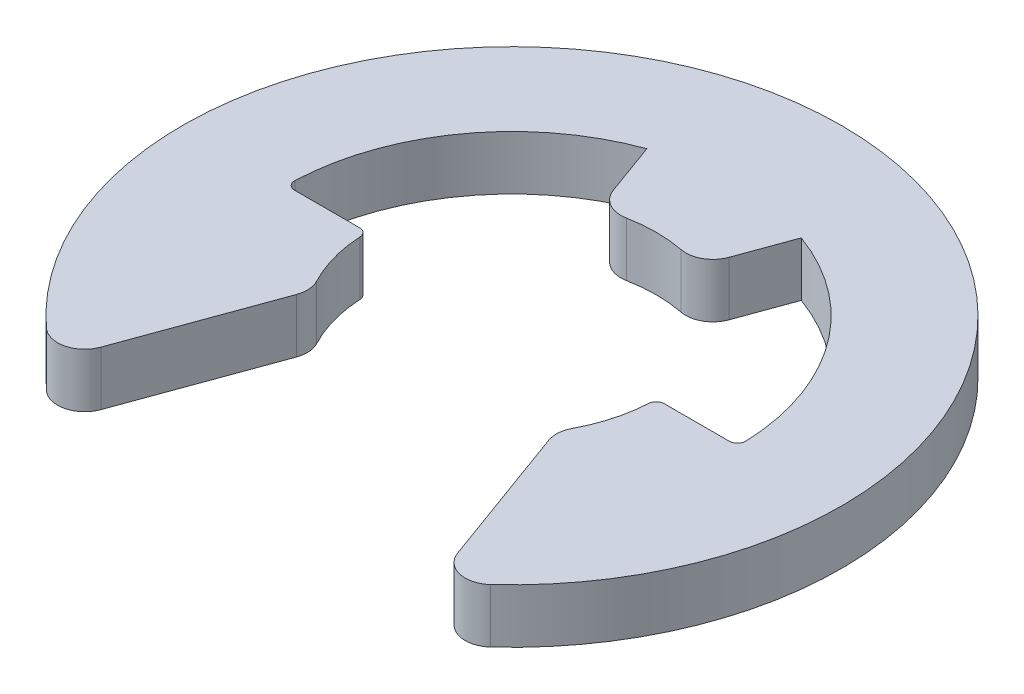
ISO-10303-21;
HEADER;
FILE_DESCRIPTION(('STEP AP214'),'2;1');
FILE_NAME('part.step','',(''),(''),'','','');
FILE_SCHEMA(('AUTOMOTIVE_DESIGN { 1 0 10303 214 1 1 1 1 }'));
ENDSEC;
DATA;
#1=APPLICATION_CONTEXT('core data for automotive mechanical design processes');
#2=APPLICATION_PROTOCOL_DEFINITION('international standard','automotive_design',2000,#1);
#3=PRODUCT_CONTEXT('',#1,'mechanical');
#4=PRODUCT('Part','Part','',(#3));
#5=PRODUCT_RELATED_PRODUCT_CATEGORY('part','',(#4));
#6=PRODUCT_DEFINITION_FORMATION('','',#4);
#7=PRODUCT_DEFINITION_CONTEXT('part definition',#1,'design');
#8=PRODUCT_DEFINITION('design','',#6,#7);
#9=PRODUCT_DEFINITION_SHAPE('','',#8);
#10=(LENGTH_UNIT() NAMED_UNIT(*) SI_UNIT(.MILLI.,.METRE.));
#11=(NAMED_UNIT(*) PLANE_ANGLE_UNIT() SI_UNIT($,.RADIAN.));
#12=(NAMED_UNIT(*) SI_UNIT($,.STERADIAN.) SOLID_ANGLE_UNIT());
#13=UNCERTAINTY_MEASURE_WITH_UNIT(LENGTH_MEASURE(1.E-05),#10,'distance_accuracy_value','');
#14=(GEOMETRIC_REPRESENTATION_CONTEXT(3) GLOBAL_UNCERTAINTY_ASSIGNED_CONTEXT((#13)) GLOBAL_UNIT_ASSIGNED_CONTEXT((#10,
#11,#12)) REPRESENTATION_CONTEXT('',''));
#15=CARTESIAN_POINT('',(0.,0.,0.));
#16=DIRECTION('',(0.,0.,1.));
#17=DIRECTION('',(1.,0.,0.));
#18=AXIS2_PLACEMENT_3D('',#15,#16,#17);
#19=CARTESIAN_POINT('',(0.,0.3,0.));
#20=DIRECTION('',(0.,-1.,0.));
#21=DIRECTION('',(0.,0.,-1.));
#22=AXIS2_PLACEMENT_3D('',#19,#20,#21);
#23=CYLINDRICAL_SURFACE('',#22,2.5);
#24=CARTESIAN_POINT('',(0.,0.3,0.));
#25=DIRECTION('',(0.,-1.,0.));
#26=DIRECTION('',(0.,0.,1.));
#27=AXIS2_PLACEMENT_3D('',#24,#25,#26);
#28=CIRCLE('',#27,2.5);
#29=CARTESIAN_POINT('',(-2.4982561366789,0.3,-0.0933609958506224));
#30=VERTEX_POINT('',#29);
#31=CARTESIAN_POINT('',(-0.855050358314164,0.3,-2.34923155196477));
#32=VERTEX_POINT('',#31);
#33=EDGE_CURVE('E187',#30,#32,#28,.T.);
#34=ORIENTED_EDGE('',*,*,#33,.F.);
#35=DIRECTION('',(0.,-1.,0.));
#36=VECTOR('',#35,1.);
#37=CARTESIAN_POINT('',(-2.4982561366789,0.3,-0.0933609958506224));
#38=LINE('',#37,#36);
#39=CARTESIAN_POINT('',(-2.4982561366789,-0.3,-0.0933609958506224));
#40=VERTEX_POINT('',#39);
#41=EDGE_CURVE('E328',#30,#40,#38,.T.);
#42=ORIENTED_EDGE('',*,*,#41,.T.);
#43=CARTESIAN_POINT('',(0.,-0.3,0.));
#44=DIRECTION('',(0.,-1.,0.));
#45=DIRECTION('',(0.,0.,1.));
#46=AXIS2_PLACEMENT_3D('',#43,#44,#45);
#47=CIRCLE('',#46,2.5);
#48=CARTESIAN_POINT('',(-0.855050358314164,-0.3,-2.34923155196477));
#49=VERTEX_POINT('',#48);
#50=EDGE_CURVE('E211',#40,#49,#47,.T.);
#51=ORIENTED_EDGE('',*,*,#50,.T.);
#52=DIRECTION('',(0.,-1.,0.));
#53=VECTOR('',#52,1.);
#54=CARTESIAN_POINT('',(-0.855050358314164,0.3,-2.34923155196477));
#55=LINE('',#54,#53);
#56=EDGE_CURVE('E204',#32,#49,#55,.T.);
#57=ORIENTED_EDGE('',*,*,#56,.F.);
#58=EDGE_LOOP('',(#34,#42,#51,#57));
#59=FACE_BOUND('',#58,.T.);
#60=ADVANCED_FACE('F39',(#59),#23,.F.);
#61=CARTESIAN_POINT('',(-0.855050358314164,0.3,-2.34923155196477));
#62=DIRECTION('',(0.939692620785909,0.,-0.342020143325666));
#63=DIRECTION('',(-0.342020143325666,0.,-0.939692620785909));
#64=AXIS2_PLACEMENT_3D('',#61,#62,#63);
#65=PLANE('',#64);
#66=DIRECTION('',(0.342020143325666,0.,0.939692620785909));
#67=VECTOR('',#66,1.);
#68=CARTESIAN_POINT('',(-0.855050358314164,-0.3,-2.34923155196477));
#69=LINE('',#68,#67);
#70=CARTESIAN_POINT('',(-0.641686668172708,-0.3,-1.76301963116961));
#71=VERTEX_POINT('',#70);
#72=EDGE_CURVE('E447',#49,#71,#69,.T.);
#73=ORIENTED_EDGE('',*,*,#72,.T.);
#74=DIRECTION('',(0.,-1.,0.));
#75=VECTOR('',#74,1.);
#76=CARTESIAN_POINT('',(-0.641686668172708,0.3,-1.76301963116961));
#77=LINE('',#76,#75);
#78=CARTESIAN_POINT('',(-0.641686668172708,0.3,-1.76301963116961));
#79=VERTEX_POINT('',#78);
#80=EDGE_CURVE('E206',#71,#79,#77,.F.);
#81=ORIENTED_EDGE('',*,*,#80,.T.);
#82=DIRECTION('',(0.342020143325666,0.,0.939692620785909));
#83=VECTOR('',#82,1.);
#84=CARTESIAN_POINT('',(-0.855050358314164,0.3,-2.34923155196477));
#85=LINE('',#84,#83);
#86=EDGE_CURVE('E191',#32,#79,#85,.T.);
#87=ORIENTED_EDGE('',*,*,#86,.F.);
#88=ORIENTED_EDGE('',*,*,#56,.T.);
#89=EDGE_LOOP('',(#73,#81,#87,#88));
#90=FACE_BOUND('',#89,.T.);
#91=ADVANCED_FACE('F203',(#90),#65,.F.);
#92=CARTESIAN_POINT('',(0.,0.3,0.));
#93=DIRECTION('',(0.,-1.,0.));
#94=DIRECTION('',(0.,0.,-1.));
#95=AXIS2_PLACEMENT_3D('',#92,#93,#94);
#96=CYLINDRICAL_SURFACE('',#95,1.6);
#97=CARTESIAN_POINT('',(0.,-0.3,0.));
#98=DIRECTION('',(0.,-1.,0.));
#99=DIRECTION('',(0.,0.,1.));
#100=AXIS2_PLACEMENT_3D('',#97,#98,#99);
#101=CIRCLE('',#100,1.6);
#102=CARTESIAN_POINT('',(-0.302971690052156,-0.3,-1.57105319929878));
#103=VERTEX_POINT('',#102);
#104=CARTESIAN_POINT('',(0.302971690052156,-0.3,-1.57105319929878));
#105=VERTEX_POINT('',#104);
#106=EDGE_CURVE('E450',#103,#105,#101,.T.);
#107=ORIENTED_EDGE('',*,*,#106,.T.);
#108=DIRECTION('',(0.,-1.,0.));
#109=VECTOR('',#108,1.);
#110=CARTESIAN_POINT('',(0.302971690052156,0.3,-1.57105319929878));
#111=LINE('',#110,#109);
#112=CARTESIAN_POINT('',(0.302971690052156,0.3,-1.57105319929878));
#113=VERTEX_POINT('',#112);
#114=EDGE_CURVE('E291',#105,#113,#111,.F.);
#115=ORIENTED_EDGE('',*,*,#114,.T.);
#116=CARTESIAN_POINT('',(0.,0.3,0.));
#117=DIRECTION('',(0.,-1.,0.));
#118=DIRECTION('',(0.,0.,1.));
#119=AXIS2_PLACEMENT_3D('',#116,#117,#118);
#120=CIRCLE('',#119,1.6);
#121=CARTESIAN_POINT('',(-0.302971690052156,0.3,-1.57105319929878));
#122=VERTEX_POINT('',#121);
#123=EDGE_CURVE('E208',#122,#113,#120,.T.);
#124=ORIENTED_EDGE('',*,*,#123,.F.);
#125=DIRECTION('',(0.,-1.,0.));
#126=VECTOR('',#125,1.);
#127=CARTESIAN_POINT('',(-0.302971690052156,0.3,-1.57105319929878));
#128=LINE('',#127,#126);
#129=EDGE_CURVE('E287',#122,#103,#128,.T.);
#130=ORIENTED_EDGE('',*,*,#129,.T.);
#131=EDGE_LOOP('',(#107,#115,#124,#130));
#132=FACE_BOUND('',#131,.T.);
#133=ADVANCED_FACE('F371',(#132),#96,.F.);
#134=CARTESIAN_POINT('',(0.547232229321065,0.3,-1.50350819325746));
#135=DIRECTION('',(-0.93969262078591,0.,-0.342020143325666));
#136=DIRECTION('',(-0.342020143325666,0.,0.93969262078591));
#137=AXIS2_PLACEMENT_3D('',#134,#135,#136);
#138=PLANE('',#137);
#139=DIRECTION('',(0.342020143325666,0.,-0.93969262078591));
#140=VECTOR('',#139,1.);
#141=CARTESIAN_POINT('',(0.547232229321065,0.3,-1.50350819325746));
#142=LINE('',#141,#140);
#143=CARTESIAN_POINT('',(0.641686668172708,0.3,-1.76301963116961));
#144=VERTEX_POINT('',#143);
#145=CARTESIAN_POINT('',(0.855050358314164,0.3,-2.34923155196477));
#146=VERTEX_POINT('',#145);
#147=EDGE_CURVE('E424',#144,#146,#142,.T.);
#148=ORIENTED_EDGE('',*,*,#147,.F.);
#149=DIRECTION('',(0.,-1.,0.));
#150=VECTOR('',#149,1.);
#151=CARTESIAN_POINT('',(0.641686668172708,0.3,-1.76301963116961));
#152=LINE('',#151,#150);
#153=CARTESIAN_POINT('',(0.641686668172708,-0.3,-1.76301963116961));
#154=VERTEX_POINT('',#153);
#155=EDGE_CURVE('E283',#144,#154,#152,.T.);
#156=ORIENTED_EDGE('',*,*,#155,.T.);
#157=DIRECTION('',(0.342020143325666,0.,-0.93969262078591));
#158=VECTOR('',#157,1.);
#159=CARTESIAN_POINT('',(0.547232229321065,-0.3,-1.50350819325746));
#160=LINE('',#159,#158);
#161=CARTESIAN_POINT('',(0.855050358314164,-0.3,-2.34923155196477));
#162=VERTEX_POINT('',#161);
#163=EDGE_CURVE('E454',#154,#162,#160,.T.);
#164=ORIENTED_EDGE('',*,*,#163,.T.);
#165=DIRECTION('',(0.,-1.,0.));
#166=VECTOR('',#165,1.);
#167=CARTESIAN_POINT('',(0.855050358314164,0.3,-2.34923155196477));
#168=LINE('',#167,#166);
#169=EDGE_CURVE('E215',#146,#162,#168,.T.);
#170=ORIENTED_EDGE('',*,*,#169,.F.);
#171=EDGE_LOOP('',(#148,#156,#164,#170));
#172=FACE_BOUND('',#171,.T.);
#173=ADVANCED_FACE('F527',(#172),#138,.F.);
#174=CARTESIAN_POINT('',(0.,0.3,0.));
#175=DIRECTION('',(0.,-1.,0.));
#176=DIRECTION('',(0.,0.,-1.));
#177=AXIS2_PLACEMENT_3D('',#174,#175,#176);
#178=CYLINDRICAL_SURFACE('',#177,2.5);
#179=CARTESIAN_POINT('',(0.,-0.3,0.));
#180=DIRECTION('',(0.,-1.,0.));
#181=DIRECTION('',(0.,0.,1.));
#182=AXIS2_PLACEMENT_3D('',#179,#180,#181);
#183=CIRCLE('',#182,2.5);
#184=CARTESIAN_POINT('',(2.4982561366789,-0.3,-0.0933609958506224));
#185=VERTEX_POINT('',#184);
#186=EDGE_CURVE('E457',#162,#185,#183,.T.);
#187=ORIENTED_EDGE('',*,*,#186,.T.);
#188=DIRECTION('',(0.,-1.,0.));
#189=VECTOR('',#188,1.);
#190=CARTESIAN_POINT('',(2.4982561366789,0.3,-0.0933609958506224));
#191=LINE('',#190,#189);
#192=CARTESIAN_POINT('',(2.4982561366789,0.3,-0.0933609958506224));
#193=VERTEX_POINT('',#192);
#194=EDGE_CURVE('E309',#185,#193,#191,.F.);
#195=ORIENTED_EDGE('',*,*,#194,.T.);
#196=CARTESIAN_POINT('',(0.,0.3,0.));
#197=DIRECTION('',(0.,-1.,0.));
#198=DIRECTION('',(0.,0.,1.));
#199=AXIS2_PLACEMENT_3D('',#196,#197,#198);
#200=CIRCLE('',#199,2.5);
#201=EDGE_CURVE('E411',#146,#193,#200,.T.);
#202=ORIENTED_EDGE('',*,*,#201,.F.);
#203=ORIENTED_EDGE('',*,*,#169,.T.);
#204=EDGE_LOOP('',(#187,#195,#202,#203));
#205=FACE_BOUND('',#204,.T.);
#206=ADVANCED_FACE('F521',(#205),#178,.F.);
#207=CARTESIAN_POINT('',(1.6,0.3,0.));
#208=DIRECTION('',(0.,0.,1.));
#209=DIRECTION('',(1.,0.,0.));
#210=AXIS2_PLACEMENT_3D('',#207,#208,#209);
#211=PLANE('',#210);
#212=DIRECTION('',(-1.,0.,0.));
#213=VECTOR('',#212,1.);
#214=CARTESIAN_POINT('',(1.6,0.3,0.));
#215=LINE('',#214,#213);
#216=CARTESIAN_POINT('',(2.40831891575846,0.3,0.));
#217=VERTEX_POINT('',#216);
#218=CARTESIAN_POINT('',(1.68760184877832,0.3,0.));
#219=VERTEX_POINT('',#218);
#220=EDGE_CURVE('E408',#217,#219,#215,.T.);
#221=ORIENTED_EDGE('',*,*,#220,.F.);
#222=DIRECTION('',(0.,1.,0.));
#223=VECTOR('',#222,1.);
#224=CARTESIAN_POINT('',(2.40831891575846,-0.3,0.));
#225=LINE('',#224,#223);
#226=CARTESIAN_POINT('',(2.40831891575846,-0.3,0.));
#227=VERTEX_POINT('',#226);
#228=EDGE_CURVE('E305',#217,#227,#225,.F.);
#229=ORIENTED_EDGE('',*,*,#228,.T.);
#230=DIRECTION('',(-1.,0.,0.));
#231=VECTOR('',#230,1.);
#232=CARTESIAN_POINT('',(1.6,-0.3,0.));
#233=LINE('',#232,#231);
#234=CARTESIAN_POINT('',(1.68760184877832,-0.3,0.));
#235=VERTEX_POINT('',#234);
#236=EDGE_CURVE('E460',#227,#235,#233,.T.);
#237=ORIENTED_EDGE('',*,*,#236,.T.);
#238=DIRECTION('',(0.,-1.,0.));
#239=VECTOR('',#238,1.);
#240=CARTESIAN_POINT('',(1.68760184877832,0.3,0.));
#241=LINE('',#240,#239);
#242=EDGE_CURVE('E302',#235,#219,#241,.F.);
#243=ORIENTED_EDGE('',*,*,#242,.T.);
#244=EDGE_LOOP('',(#221,#229,#237,#243));
#245=FACE_BOUND('',#244,.T.);
#246=ADVANCED_FACE('F413',(#245),#211,.F.);
#247=CARTESIAN_POINT('',(0.,0.3,0.));
#248=DIRECTION('',(0.,-1.,0.));
#249=DIRECTION('',(0.,0.,-1.));
#250=AXIS2_PLACEMENT_3D('',#247,#248,#249);
#251=CYLINDRICAL_SURFACE('',#250,1.6);
#252=CARTESIAN_POINT('',(0.,0.3,0.));
#253=DIRECTION('',(0.,-1.,0.));
#254=DIRECTION('',(0.,0.,1.));
#255=AXIS2_PLACEMENT_3D('',#252,#253,#254);
#256=CIRCLE('',#255,1.6);
#257=CARTESIAN_POINT('',(1.59772956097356,0.3,0.085207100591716));
#258=VERTEX_POINT('',#257);
#259=CARTESIAN_POINT('',(1.41458509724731,0.3,0.747628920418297));
#260=VERTEX_POINT('',#259);
#261=EDGE_CURVE('E418',#258,#260,#256,.T.);
#262=ORIENTED_EDGE('',*,*,#261,.F.);
#263=DIRECTION('',(0.,-1.,0.));
#264=VECTOR('',#263,1.);
#265=CARTESIAN_POINT('',(1.59772956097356,0.3,0.085207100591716));
#266=LINE('',#265,#264);
#267=CARTESIAN_POINT('',(1.59772956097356,-0.3,0.085207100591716));
#268=VERTEX_POINT('',#267);
#269=EDGE_CURVE('E312',#258,#268,#266,.T.);
#270=ORIENTED_EDGE('',*,*,#269,.T.);
#271=CARTESIAN_POINT('',(0.,-0.3,0.));
#272=DIRECTION('',(0.,-1.,0.));
#273=DIRECTION('',(0.,0.,1.));
#274=AXIS2_PLACEMENT_3D('',#271,#272,#273);
#275=CIRCLE('',#274,1.6);
#276=CARTESIAN_POINT('',(1.41458509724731,-0.3,0.747628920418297));
#277=VERTEX_POINT('',#276);
#278=EDGE_CURVE('E463',#268,#277,#275,.T.);
#279=ORIENTED_EDGE('',*,*,#278,.T.);
#280=DIRECTION('',(0.,-1.,0.));
#281=VECTOR('',#280,1.);
#282=CARTESIAN_POINT('',(1.41458509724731,0.3,0.747628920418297));
#283=LINE('',#282,#281);
#284=EDGE_CURVE('E250',#277,#260,#283,.F.);
#285=ORIENTED_EDGE('',*,*,#284,.T.);
#286=EDGE_LOOP('',(#262,#270,#279,#285));
#287=FACE_BOUND('',#286,.T.);
#288=ADVANCED_FACE('F512',(#287),#251,.F.);
#289=CARTESIAN_POINT('',(1.35,0.3,0.858778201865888));
#290=DIRECTION('',(0.939692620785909,0.,-0.342020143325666));
#291=DIRECTION('',(-0.342020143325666,0.,-0.939692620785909));
#292=AXIS2_PLACEMENT_3D('',#289,#290,#291);
#293=PLANE('',#292);
#294=DIRECTION('',(0.342020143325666,0.,0.939692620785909));
#295=VECTOR('',#294,1.);
#296=CARTESIAN_POINT('',(1.35,0.3,0.858778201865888));
#297=LINE('',#296,#295);
#298=CARTESIAN_POINT('',(1.3979120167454,0.3,0.990415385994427));
#299=VERTEX_POINT('',#298);
#300=CARTESIAN_POINT('',(1.97563108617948,0.3,2.57768548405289));
#301=VERTEX_POINT('',#300);
#302=EDGE_CURVE('E421',#299,#301,#297,.T.);
#303=ORIENTED_EDGE('',*,*,#302,.F.);
#304=DIRECTION('',(0.,-1.,0.));
#305=VECTOR('',#304,1.);
#306=CARTESIAN_POINT('',(1.3979120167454,0.3,0.990415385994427));
#307=LINE('',#306,#305);
#308=CARTESIAN_POINT('',(1.3979120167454,-0.3,0.990415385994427));
#309=VERTEX_POINT('',#308);
#310=EDGE_CURVE('E220',#299,#309,#307,.T.);
#311=ORIENTED_EDGE('',*,*,#310,.T.);
#312=DIRECTION('',(0.342020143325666,0.,0.939692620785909));
#313=VECTOR('',#312,1.);
#314=CARTESIAN_POINT('',(1.35,-0.3,0.858778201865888));
#315=LINE('',#314,#313);
#316=CARTESIAN_POINT('',(1.97563108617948,-0.3,2.57768548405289));
#317=VERTEX_POINT('',#316);
#318=EDGE_CURVE('E466',#309,#317,#315,.T.);
#319=ORIENTED_EDGE('',*,*,#318,.T.);
#320=DIRECTION('',(0.,-1.,0.));
#321=VECTOR('',#320,1.);
#322=CARTESIAN_POINT('',(1.97563108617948,0.3,2.57768548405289));
#323=LINE('',#322,#321);
#324=EDGE_CURVE('E214',#317,#301,#323,.F.);
#325=ORIENTED_EDGE('',*,*,#324,.T.);
#326=EDGE_LOOP('',(#303,#311,#319,#325));
#327=FACE_BOUND('',#326,.T.);
#328=ADVANCED_FACE('F506',(#327),#293,.F.);
#329=CARTESIAN_POINT('',(0.,0.3,0.));
#330=DIRECTION('',(0.,-1.,0.));
#331=DIRECTION('',(0.,0.,-1.));
#332=AXIS2_PLACEMENT_3D('',#329,#330,#331);
#333=CYLINDRICAL_SURFACE('',#332,3.65);
#334=CARTESIAN_POINT('',(0.,0.3,0.));
#335=DIRECTION('',(0.,1.,0.));
#336=DIRECTION('',(0.,0.,1.));
#337=AXIS2_PLACEMENT_3D('',#334,#335,#336);
#338=CIRCLE('',#337,3.65);
#339=CARTESIAN_POINT('',(2.45970653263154,0.3,2.69672834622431));
#340=VERTEX_POINT('',#339);
#341=CARTESIAN_POINT('',(-2.45970653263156,0.3,2.6967283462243));
#342=VERTEX_POINT('',#341);
#343=EDGE_CURVE('E431',#340,#342,#338,.T.);
#344=ORIENTED_EDGE('',*,*,#343,.F.);
#345=DIRECTION('',(0.,-1.,0.));
#346=VECTOR('',#345,1.);
#347=CARTESIAN_POINT('',(2.45970653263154,0.3,2.69672834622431));
#348=LINE('',#347,#346);
#349=CARTESIAN_POINT('',(2.45970653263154,-0.3,2.69672834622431));
#350=VERTEX_POINT('',#349);
#351=EDGE_CURVE('E298',#340,#350,#348,.T.);
#352=ORIENTED_EDGE('',*,*,#351,.T.);
#353=CARTESIAN_POINT('',(0.,-0.3,0.));
#354=DIRECTION('',(0.,1.,0.));
#355=DIRECTION('',(0.,0.,1.));
#356=AXIS2_PLACEMENT_3D('',#353,#354,#355);
#357=CIRCLE('',#356,3.65);
#358=CARTESIAN_POINT('',(-2.45970653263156,-0.3,2.6967283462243));
#359=VERTEX_POINT('',#358);
#360=EDGE_CURVE('E470',#350,#359,#357,.T.);
#361=ORIENTED_EDGE('',*,*,#360,.T.);
#362=DIRECTION('',(0.,-1.,0.));
#363=VECTOR('',#362,1.);
#364=CARTESIAN_POINT('',(-2.45970653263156,0.3,2.6967283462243));
#365=LINE('',#364,#363);
#366=EDGE_CURVE('E295',#359,#342,#365,.F.);
#367=ORIENTED_EDGE('',*,*,#366,.T.);
#368=EDGE_LOOP('',(#344,#352,#361,#367));
#369=FACE_BOUND('',#368,.T.);
#370=ADVANCED_FACE('F499',(#369),#333,.T.);
#371=CARTESIAN_POINT('',(-2.11909732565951,0.3,2.9718557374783));
#372=DIRECTION('',(-0.939692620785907,0.,-0.342020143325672));
#373=DIRECTION('',(-0.342020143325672,0.,0.939692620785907));
#374=AXIS2_PLACEMENT_3D('',#371,#372,#373);
#375=PLANE('',#374);
#376=DIRECTION('',(0.342020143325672,0.,-0.939692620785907));
#377=VECTOR('',#376,1.);
#378=CARTESIAN_POINT('',(-2.11909732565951,-0.3,2.9718557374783));
#379=LINE('',#378,#377);
#380=CARTESIAN_POINT('',(-1.97563108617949,-0.3,2.57768548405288));
#381=VERTEX_POINT('',#380);
#382=CARTESIAN_POINT('',(-1.39791201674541,-0.3,0.990415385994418));
#383=VERTEX_POINT('',#382);
#384=EDGE_CURVE('E474',#381,#383,#379,.T.);
#385=ORIENTED_EDGE('',*,*,#384,.T.);
#386=DIRECTION('',(0.,-1.,0.));
#387=VECTOR('',#386,1.);
#388=CARTESIAN_POINT('',(-1.39791201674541,0.3,0.990415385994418));
#389=LINE('',#388,#387);
#390=CARTESIAN_POINT('',(-1.39791201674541,0.3,0.990415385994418));
#391=VERTEX_POINT('',#390);
#392=EDGE_CURVE('E280',#383,#391,#389,.F.);
#393=ORIENTED_EDGE('',*,*,#392,.T.);
#394=DIRECTION('',(0.342020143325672,0.,-0.939692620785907));
#395=VECTOR('',#394,1.);
#396=CARTESIAN_POINT('',(-2.11909732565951,0.3,2.9718557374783));
#397=LINE('',#396,#395);
#398=CARTESIAN_POINT('',(-1.97563108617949,0.3,2.57768548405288));
#399=VERTEX_POINT('',#398);
#400=EDGE_CURVE('E435',#399,#391,#397,.T.);
#401=ORIENTED_EDGE('',*,*,#400,.F.);
#402=DIRECTION('',(0.,-1.,0.));
#403=VECTOR('',#402,1.);
#404=CARTESIAN_POINT('',(-1.97563108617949,0.3,2.57768548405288));
#405=LINE('',#404,#403);
#406=EDGE_CURVE('E276',#399,#381,#405,.T.);
#407=ORIENTED_EDGE('',*,*,#406,.T.);
#408=EDGE_LOOP('',(#385,#393,#401,#407));
#409=FACE_BOUND('',#408,.T.);
#410=ADVANCED_FACE('F491',(#409),#375,.F.);
#411=CARTESIAN_POINT('',(0.,0.3,0.));
#412=DIRECTION('',(0.,-1.,0.));
#413=DIRECTION('',(0.,0.,-1.));
#414=AXIS2_PLACEMENT_3D('',#411,#412,#413);
#415=CYLINDRICAL_SURFACE('',#414,1.6);
#416=CARTESIAN_POINT('',(0.,-0.3,0.));
#417=DIRECTION('',(0.,-1.,0.));
#418=DIRECTION('',(0.,0.,1.));
#419=AXIS2_PLACEMENT_3D('',#416,#417,#418);
#420=CIRCLE('',#419,1.6);
#421=CARTESIAN_POINT('',(-1.41458509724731,-0.3,0.747628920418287));
#422=VERTEX_POINT('',#421);
#423=CARTESIAN_POINT('',(-1.59772956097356,-0.3,0.085207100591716));
#424=VERTEX_POINT('',#423);
#425=EDGE_CURVE('E354',#422,#424,#420,.T.);
#426=ORIENTED_EDGE('',*,*,#425,.T.);
#427=DIRECTION('',(0.,-1.,0.));
#428=VECTOR('',#427,1.);
#429=CARTESIAN_POINT('',(-1.59772956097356,0.3,0.085207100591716));
#430=LINE('',#429,#428);
#431=CARTESIAN_POINT('',(-1.59772956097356,0.3,0.085207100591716));
#432=VERTEX_POINT('',#431);
#433=EDGE_CURVE('E337',#424,#432,#430,.F.);
#434=ORIENTED_EDGE('',*,*,#433,.T.);
#435=CARTESIAN_POINT('',(0.,0.3,0.));
#436=DIRECTION('',(0.,-1.,0.));
#437=DIRECTION('',(0.,0.,1.));
#438=AXIS2_PLACEMENT_3D('',#435,#436,#437);
#439=CIRCLE('',#438,1.6);
#440=CARTESIAN_POINT('',(-1.41458509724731,0.3,0.747628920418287));
#441=VERTEX_POINT('',#440);
#442=EDGE_CURVE('E439',#441,#432,#439,.T.);
#443=ORIENTED_EDGE('',*,*,#442,.F.);
#444=DIRECTION('',(0.,-1.,0.));
#445=VECTOR('',#444,1.);
#446=CARTESIAN_POINT('',(-1.41458509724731,0.3,0.747628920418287));
#447=LINE('',#446,#445);
#448=EDGE_CURVE('E272',#441,#422,#447,.T.);
#449=ORIENTED_EDGE('',*,*,#448,.T.);
#450=EDGE_LOOP('',(#426,#434,#443,#449));
#451=FACE_BOUND('',#450,.T.);
#452=ADVANCED_FACE('F483',(#451),#415,.F.);
#453=CARTESIAN_POINT('',(-1.6,0.3,0.));
#454=DIRECTION('',(0.,0.,1.));
#455=DIRECTION('',(1.,0.,0.));
#456=AXIS2_PLACEMENT_3D('',#453,#454,#455);
#457=PLANE('',#456);
#458=DIRECTION('',(-1.,0.,0.));
#459=VECTOR('',#458,1.);
#460=CARTESIAN_POINT('',(-1.6,-0.3,0.));
#461=LINE('',#460,#459);
#462=CARTESIAN_POINT('',(-1.68760184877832,-0.3,0.));
#463=VERTEX_POINT('',#462);
#464=CARTESIAN_POINT('',(-2.40831891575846,-0.3,0.));
#465=VERTEX_POINT('',#464);
#466=EDGE_CURVE('E198',#463,#465,#461,.T.);
#467=ORIENTED_EDGE('',*,*,#466,.T.);
#468=DIRECTION('',(0.,1.,0.));
#469=VECTOR('',#468,1.);
#470=CARTESIAN_POINT('',(-2.40831891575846,0.3,0.));
#471=LINE('',#470,#469);
#472=CARTESIAN_POINT('',(-2.40831891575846,0.3,0.));
#473=VERTEX_POINT('',#472);
#474=EDGE_CURVE('E61',#465,#473,#471,.T.);
#475=ORIENTED_EDGE('',*,*,#474,.T.);
#476=DIRECTION('',(-1.,0.,0.));
#477=VECTOR('',#476,1.);
#478=CARTESIAN_POINT('',(-1.6,0.3,0.));
#479=LINE('',#478,#477);
#480=CARTESIAN_POINT('',(-1.68760184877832,0.3,0.));
#481=VERTEX_POINT('',#480);
#482=EDGE_CURVE('E224',#481,#473,#479,.T.);
#483=ORIENTED_EDGE('',*,*,#482,.F.);
#484=DIRECTION('',(0.,-1.,0.));
#485=VECTOR('',#484,1.);
#486=CARTESIAN_POINT('',(-1.68760184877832,0.3,0.));
#487=LINE('',#486,#485);
#488=EDGE_CURVE('E331',#481,#463,#487,.T.);
#489=ORIENTED_EDGE('',*,*,#488,.T.);
#490=EDGE_LOOP('',(#467,#475,#483,#489));
#491=FACE_BOUND('',#490,.T.);
#492=ADVANCED_FACE('F351',(#491),#457,.F.);
#493=CARTESIAN_POINT('',(0.,0.3,0.));
#494=DIRECTION('',(0.,1.,0.));
#495=DIRECTION('',(0.,0.,1.));
#496=AXIS2_PLACEMENT_3D('',#493,#494,#495);
#497=PLANE('',#496);
#498=ORIENTED_EDGE('',*,*,#220,.T.);
#499=CARTESIAN_POINT('',(1.68760184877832,0.3,0.09));
#500=DIRECTION('',(0.,1.,0.));
#501=DIRECTION('',(0.,0.,1.));
#502=AXIS2_PLACEMENT_3D('',#499,#500,#501);
#503=CIRCLE('',#502,0.09);
#504=EDGE_CURVE('E325',#219,#258,#503,.T.);
#505=ORIENTED_EDGE('',*,*,#504,.T.);
#506=ORIENTED_EDGE('',*,*,#261,.T.);
#507=CARTESIAN_POINT('',(1.67981980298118,0.3,0.887809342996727));
#508=DIRECTION('',(0.,1.,0.));
#509=DIRECTION('',(0.,0.,1.));
#510=AXIS2_PLACEMENT_3D('',#507,#508,#509);
#511=CIRCLE('',#510,0.3);
#512=EDGE_CURVE('E269',#260,#299,#511,.T.);
#513=ORIENTED_EDGE('',*,*,#512,.T.);
#514=ORIENTED_EDGE('',*,*,#302,.T.);
#515=CARTESIAN_POINT('',(2.25753887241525,0.3,2.47507944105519));
#516=DIRECTION('',(0.,1.,0.));
#517=DIRECTION('',(0.,0.,1.));
#518=AXIS2_PLACEMENT_3D('',#515,#516,#517);
#519=CIRCLE('',#518,0.3);
#520=EDGE_CURVE('E257',#301,#340,#519,.T.);
#521=ORIENTED_EDGE('',*,*,#520,.T.);
#522=ORIENTED_EDGE('',*,*,#343,.T.);
#523=CARTESIAN_POINT('',(-2.25753887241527,0.3,2.47507944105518));
#524=DIRECTION('',(0.,1.,0.));
#525=DIRECTION('',(0.,0.,1.));
#526=AXIS2_PLACEMENT_3D('',#523,#524,#525);
#527=CIRCLE('',#526,0.3);
#528=EDGE_CURVE('E254',#342,#399,#527,.T.);
#529=ORIENTED_EDGE('',*,*,#528,.T.);
#530=ORIENTED_EDGE('',*,*,#400,.T.);
#531=CARTESIAN_POINT('',(-1.67981980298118,0.3,0.887809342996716));
#532=DIRECTION('',(0.,1.,0.));
#533=DIRECTION('',(0.,0.,1.));
#534=AXIS2_PLACEMENT_3D('',#531,#532,#533);
#535=CIRCLE('',#534,0.3);
#536=EDGE_CURVE('E266',#391,#441,#535,.T.);
#537=ORIENTED_EDGE('',*,*,#536,.T.);
#538=ORIENTED_EDGE('',*,*,#442,.T.);
#539=CARTESIAN_POINT('',(-1.68760184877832,0.3,0.09));
#540=DIRECTION('',(0.,1.,0.));
#541=DIRECTION('',(0.,0.,1.));
#542=AXIS2_PLACEMENT_3D('',#539,#540,#541);
#543=CIRCLE('',#542,0.09);
#544=EDGE_CURVE('E322',#432,#481,#543,.T.);
#545=ORIENTED_EDGE('',*,*,#544,.T.);
#546=ORIENTED_EDGE('',*,*,#482,.T.);
#547=CARTESIAN_POINT('',(-2.40831891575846,0.3,-0.09));
#548=DIRECTION('',(0.,1.,0.));
#549=DIRECTION('',(0.,0.,1.));
#550=AXIS2_PLACEMENT_3D('',#547,#548,#549);
#551=CIRCLE('',#550,0.09);
#552=EDGE_CURVE('E11',#473,#30,#551,.F.);
#553=ORIENTED_EDGE('',*,*,#552,.T.);
#554=ORIENTED_EDGE('',*,*,#33,.T.);
#555=ORIENTED_EDGE('',*,*,#86,.T.);
#556=CARTESIAN_POINT('',(-0.359778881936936,0.3,-1.8656256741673));
#557=DIRECTION('',(0.,1.,0.));
#558=DIRECTION('',(0.,0.,1.));
#559=AXIS2_PLACEMENT_3D('',#556,#557,#558);
#560=CIRCLE('',#559,0.3);
#561=EDGE_CURVE('E260',#79,#122,#560,.T.);
#562=ORIENTED_EDGE('',*,*,#561,.T.);
#563=ORIENTED_EDGE('',*,*,#123,.T.);
#564=CARTESIAN_POINT('',(0.359778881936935,0.3,-1.86562567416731));
#565=DIRECTION('',(0.,1.,0.));
#566=DIRECTION('',(0.,0.,1.));
#567=AXIS2_PLACEMENT_3D('',#564,#565,#566);
#568=CIRCLE('',#567,0.3);
#569=EDGE_CURVE('E263',#113,#144,#568,.T.);
#570=ORIENTED_EDGE('',*,*,#569,.T.);
#571=ORIENTED_EDGE('',*,*,#147,.T.);
#572=ORIENTED_EDGE('',*,*,#201,.T.);
#573=CARTESIAN_POINT('',(2.40831891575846,0.3,-0.09));
#574=DIRECTION('',(0.,1.,0.));
#575=DIRECTION('',(0.,0.,1.));
#576=AXIS2_PLACEMENT_3D('',#573,#574,#575);
#577=CIRCLE('',#576,0.09);
#578=EDGE_CURVE('E343',#193,#217,#577,.F.);
#579=ORIENTED_EDGE('',*,*,#578,.T.);
#580=EDGE_LOOP('',(#498,#505,#506,#513,#514,#521,#522,#529,#530,#537,#538,#545,#546,#553,#554,
#555,#562,#563,#570,#571,#572,#579));
#581=FACE_BOUND('',#580,.T.);
#582=ADVANCED_FACE('F190',(#581),#497,.T.);
#583=CARTESIAN_POINT('',(0.,-0.3,0.));
#584=DIRECTION('',(0.,1.,0.));
#585=DIRECTION('',(0.,0.,1.));
#586=AXIS2_PLACEMENT_3D('',#583,#584,#585);
#587=PLANE('',#586);
#588=ORIENTED_EDGE('',*,*,#278,.F.);
#589=CARTESIAN_POINT('',(1.68760184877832,-0.3,0.09));
#590=DIRECTION('',(0.,1.,0.));
#591=DIRECTION('',(0.,0.,1.));
#592=AXIS2_PLACEMENT_3D('',#589,#590,#591);
#593=CIRCLE('',#592,0.09);
#594=EDGE_CURVE('E319',#268,#235,#593,.F.);
#595=ORIENTED_EDGE('',*,*,#594,.T.);
#596=ORIENTED_EDGE('',*,*,#236,.F.);
#597=CARTESIAN_POINT('',(2.40831891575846,-0.3,-0.09));
#598=DIRECTION('',(0.,1.,0.));
#599=DIRECTION('',(0.,0.,1.));
#600=AXIS2_PLACEMENT_3D('',#597,#598,#599);
#601=CIRCLE('',#600,0.09);
#602=EDGE_CURVE('E340',#227,#185,#601,.T.);
#603=ORIENTED_EDGE('',*,*,#602,.T.);
#604=ORIENTED_EDGE('',*,*,#186,.F.);
#605=ORIENTED_EDGE('',*,*,#163,.F.);
#606=CARTESIAN_POINT('',(0.359778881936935,-0.3,-1.86562567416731));
#607=DIRECTION('',(0.,1.,0.));
#608=DIRECTION('',(0.,0.,1.));
#609=AXIS2_PLACEMENT_3D('',#606,#607,#608);
#610=CIRCLE('',#609,0.3);
#611=EDGE_CURVE('E240',#154,#105,#610,.F.);
#612=ORIENTED_EDGE('',*,*,#611,.T.);
#613=ORIENTED_EDGE('',*,*,#106,.F.);
#614=CARTESIAN_POINT('',(-0.359778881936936,-0.3,-1.8656256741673));
#615=DIRECTION('',(0.,1.,0.));
#616=DIRECTION('',(0.,0.,1.));
#617=AXIS2_PLACEMENT_3D('',#614,#615,#616);
#618=CIRCLE('',#617,0.3);
#619=EDGE_CURVE('E237',#103,#71,#618,.F.);
#620=ORIENTED_EDGE('',*,*,#619,.T.);
#621=ORIENTED_EDGE('',*,*,#72,.F.);
#622=ORIENTED_EDGE('',*,*,#50,.F.);
#623=CARTESIAN_POINT('',(-2.40831891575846,-0.3,-0.09));
#624=DIRECTION('',(0.,1.,0.));
#625=DIRECTION('',(0.,0.,1.));
#626=AXIS2_PLACEMENT_3D('',#623,#624,#625);
#627=CIRCLE('',#626,0.09);
#628=EDGE_CURVE('E48',#40,#465,#627,.T.);
#629=ORIENTED_EDGE('',*,*,#628,.T.);
#630=ORIENTED_EDGE('',*,*,#466,.F.);
#631=CARTESIAN_POINT('',(-1.68760184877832,-0.3,0.09));
#632=DIRECTION('',(0.,1.,0.));
#633=DIRECTION('',(0.,0.,1.));
#634=AXIS2_PLACEMENT_3D('',#631,#632,#633);
#635=CIRCLE('',#634,0.09);
#636=EDGE_CURVE('E316',#463,#424,#635,.F.);
#637=ORIENTED_EDGE('',*,*,#636,.T.);
#638=ORIENTED_EDGE('',*,*,#425,.F.);
#639=CARTESIAN_POINT('',(-1.67981980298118,-0.3,0.887809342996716));
#640=DIRECTION('',(0.,1.,0.));
#641=DIRECTION('',(0.,0.,1.));
#642=AXIS2_PLACEMENT_3D('',#639,#640,#641);
#643=CIRCLE('',#642,0.3);
#644=EDGE_CURVE('E243',#422,#383,#643,.F.);
#645=ORIENTED_EDGE('',*,*,#644,.T.);
#646=ORIENTED_EDGE('',*,*,#384,.F.);
#647=CARTESIAN_POINT('',(-2.25753887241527,-0.3,2.47507944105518));
#648=DIRECTION('',(0.,1.,0.));
#649=DIRECTION('',(0.,0.,1.));
#650=AXIS2_PLACEMENT_3D('',#647,#648,#649);
#651=CIRCLE('',#650,0.3);
#652=EDGE_CURVE('E231',#381,#359,#651,.F.);
#653=ORIENTED_EDGE('',*,*,#652,.T.);
#654=ORIENTED_EDGE('',*,*,#360,.F.);
#655=CARTESIAN_POINT('',(2.25753887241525,-0.3,2.47507944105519));
#656=DIRECTION('',(0.,1.,0.));
#657=DIRECTION('',(0.,0.,1.));
#658=AXIS2_PLACEMENT_3D('',#655,#656,#657);
#659=CIRCLE('',#658,0.3);
#660=EDGE_CURVE('E234',#350,#317,#659,.F.);
#661=ORIENTED_EDGE('',*,*,#660,.T.);
#662=ORIENTED_EDGE('',*,*,#318,.F.);
#663=CARTESIAN_POINT('',(1.67981980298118,-0.3,0.887809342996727));
#664=DIRECTION('',(0.,1.,0.));
#665=DIRECTION('',(0.,0.,1.));
#666=AXIS2_PLACEMENT_3D('',#663,#664,#665);
#667=CIRCLE('',#666,0.3);
#668=EDGE_CURVE('E246',#309,#277,#667,.F.);
#669=ORIENTED_EDGE('',*,*,#668,.T.);
#670=EDGE_LOOP('',(#588,#595,#596,#603,#604,#605,#612,#613,#620,#621,#622,#629,#630,#637,#638,
#645,#646,#653,#654,#661,#662,#669));
#671=FACE_BOUND('',#670,.T.);
#672=ADVANCED_FACE('F349',(#671),#587,.F.);
#673=CARTESIAN_POINT('',(1.67981980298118,0.3,0.887809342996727));
#674=DIRECTION('',(0.,-1.,0.));
#675=DIRECTION('',(0.,0.,-1.));
#676=AXIS2_PLACEMENT_3D('',#673,#674,#675);
#677=CYLINDRICAL_SURFACE('',#676,0.3);
#678=ORIENTED_EDGE('',*,*,#512,.F.);
#679=ORIENTED_EDGE('',*,*,#284,.F.);
#680=ORIENTED_EDGE('',*,*,#668,.F.);
#681=ORIENTED_EDGE('',*,*,#310,.F.);
#682=EDGE_LOOP('',(#678,#679,#680,#681));
#683=FACE_BOUND('',#682,.T.);
#684=ADVANCED_FACE('F375',(#683),#677,.T.);
#685=CARTESIAN_POINT('',(-1.67981980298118,0.3,0.887809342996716));
#686=DIRECTION('',(0.,-1.,0.));
#687=DIRECTION('',(0.,0.,-1.));
#688=AXIS2_PLACEMENT_3D('',#685,#686,#687);
#689=CYLINDRICAL_SURFACE('',#688,0.3);
#690=ORIENTED_EDGE('',*,*,#536,.F.);
#691=ORIENTED_EDGE('',*,*,#392,.F.);
#692=ORIENTED_EDGE('',*,*,#644,.F.);
#693=ORIENTED_EDGE('',*,*,#448,.F.);
#694=EDGE_LOOP('',(#690,#691,#692,#693));
#695=FACE_BOUND('',#694,.T.);
#696=ADVANCED_FACE('F378',(#695),#689,.T.);
#697=CARTESIAN_POINT('',(0.359778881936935,0.3,-1.86562567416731));
#698=DIRECTION('',(0.,-1.,0.));
#699=DIRECTION('',(0.,0.,-1.));
#700=AXIS2_PLACEMENT_3D('',#697,#698,#699);
#701=CYLINDRICAL_SURFACE('',#700,0.3);
#702=ORIENTED_EDGE('',*,*,#569,.F.);
#703=ORIENTED_EDGE('',*,*,#114,.F.);
#704=ORIENTED_EDGE('',*,*,#611,.F.);
#705=ORIENTED_EDGE('',*,*,#155,.F.);
#706=EDGE_LOOP('',(#702,#703,#704,#705));
#707=FACE_BOUND('',#706,.T.);
#708=ADVANCED_FACE('F382',(#707),#701,.T.);
#709=CARTESIAN_POINT('',(-0.359778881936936,0.3,-1.8656256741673));
#710=DIRECTION('',(0.,-1.,0.));
#711=DIRECTION('',(0.,0.,-1.));
#712=AXIS2_PLACEMENT_3D('',#709,#710,#711);
#713=CYLINDRICAL_SURFACE('',#712,0.3);
#714=ORIENTED_EDGE('',*,*,#561,.F.);
#715=ORIENTED_EDGE('',*,*,#80,.F.);
#716=ORIENTED_EDGE('',*,*,#619,.F.);
#717=ORIENTED_EDGE('',*,*,#129,.F.);
#718=EDGE_LOOP('',(#714,#715,#716,#717));
#719=FACE_BOUND('',#718,.T.);
#720=ADVANCED_FACE('F386',(#719),#713,.T.);
#721=CARTESIAN_POINT('',(2.25753887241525,0.3,2.47507944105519));
#722=DIRECTION('',(0.,-1.,0.));
#723=DIRECTION('',(0.,0.,-1.));
#724=AXIS2_PLACEMENT_3D('',#721,#722,#723);
#725=CYLINDRICAL_SURFACE('',#724,0.3);
#726=ORIENTED_EDGE('',*,*,#520,.F.);
#727=ORIENTED_EDGE('',*,*,#324,.F.);
#728=ORIENTED_EDGE('',*,*,#660,.F.);
#729=ORIENTED_EDGE('',*,*,#351,.F.);
#730=EDGE_LOOP('',(#726,#727,#728,#729));
#731=FACE_BOUND('',#730,.T.);
#732=ADVANCED_FACE('F390',(#731),#725,.T.);
#733=CARTESIAN_POINT('',(-2.25753887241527,0.3,2.47507944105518));
#734=DIRECTION('',(0.,-1.,0.));
#735=DIRECTION('',(0.,0.,-1.));
#736=AXIS2_PLACEMENT_3D('',#733,#734,#735);
#737=CYLINDRICAL_SURFACE('',#736,0.3);
#738=ORIENTED_EDGE('',*,*,#528,.F.);
#739=ORIENTED_EDGE('',*,*,#366,.F.);
#740=ORIENTED_EDGE('',*,*,#652,.F.);
#741=ORIENTED_EDGE('',*,*,#406,.F.);
#742=EDGE_LOOP('',(#738,#739,#740,#741));
#743=FACE_BOUND('',#742,.T.);
#744=ADVANCED_FACE('F394',(#743),#737,.T.);
#745=CARTESIAN_POINT('',(2.40831891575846,0.3,-0.09));
#746=DIRECTION('',(0.,-1.,0.));
#747=DIRECTION('',(0.,0.,-1.));
#748=AXIS2_PLACEMENT_3D('',#745,#746,#747);
#749=CYLINDRICAL_SURFACE('',#748,0.09);
#750=ORIENTED_EDGE('',*,*,#578,.F.);
#751=ORIENTED_EDGE('',*,*,#194,.F.);
#752=ORIENTED_EDGE('',*,*,#602,.F.);
#753=ORIENTED_EDGE('',*,*,#228,.F.);
#754=EDGE_LOOP('',(#750,#751,#752,#753));
#755=FACE_BOUND('',#754,.T.);
#756=ADVANCED_FACE('F363',(#755),#749,.F.);
#757=CARTESIAN_POINT('',(1.68760184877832,0.3,0.09));
#758=DIRECTION('',(0.,-1.,0.));
#759=DIRECTION('',(0.,0.,-1.));
#760=AXIS2_PLACEMENT_3D('',#757,#758,#759);
#761=CYLINDRICAL_SURFACE('',#760,0.09);
#762=ORIENTED_EDGE('',*,*,#504,.F.);
#763=ORIENTED_EDGE('',*,*,#242,.F.);
#764=ORIENTED_EDGE('',*,*,#594,.F.);
#765=ORIENTED_EDGE('',*,*,#269,.F.);
#766=EDGE_LOOP('',(#762,#763,#764,#765));
#767=FACE_BOUND('',#766,.T.);
#768=ADVANCED_FACE('F357',(#767),#761,.T.);
#769=CARTESIAN_POINT('',(-2.40831891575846,0.3,-0.09));
#770=DIRECTION('',(0.,-1.,0.));
#771=DIRECTION('',(0.,0.,-1.));
#772=AXIS2_PLACEMENT_3D('',#769,#770,#771);
#773=CYLINDRICAL_SURFACE('',#772,0.09);
#774=ORIENTED_EDGE('',*,*,#552,.F.);
#775=ORIENTED_EDGE('',*,*,#474,.F.);
#776=ORIENTED_EDGE('',*,*,#628,.F.);
#777=ORIENTED_EDGE('',*,*,#41,.F.);
#778=EDGE_LOOP('',(#774,#775,#776,#777));
#779=FACE_BOUND('',#778,.T.);
#780=ADVANCED_FACE('F355',(#779),#773,.F.);
#781=CARTESIAN_POINT('',(-1.68760184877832,0.3,0.09));
#782=DIRECTION('',(0.,-1.,0.));
#783=DIRECTION('',(0.,0.,-1.));
#784=AXIS2_PLACEMENT_3D('',#781,#782,#783);
#785=CYLINDRICAL_SURFACE('',#784,0.09);
#786=ORIENTED_EDGE('',*,*,#544,.F.);
#787=ORIENTED_EDGE('',*,*,#433,.F.);
#788=ORIENTED_EDGE('',*,*,#636,.F.);
#789=ORIENTED_EDGE('',*,*,#488,.F.);
#790=EDGE_LOOP('',(#786,#787,#788,#789));
#791=FACE_BOUND('',#790,.T.);
#792=ADVANCED_FACE('F41',(#791),#785,.T.);
#793=CLOSED_SHELL('',(#60,#91,#133,#173,#206,#246,#288,#328,#370,#410,#452,#492,#582,#672,#684,
#696,#708,#720,#732,#744,#756,#768,#780,#792));
#794=MANIFOLD_SOLID_BREP('B2',#793);
#795=ADVANCED_BREP_SHAPE_REPRESENTATION('',(#18,#794),#14);
#796=SHAPE_DEFINITION_REPRESENTATION(#9,#795);
ENDSEC;
END-ISO-10303-21;
